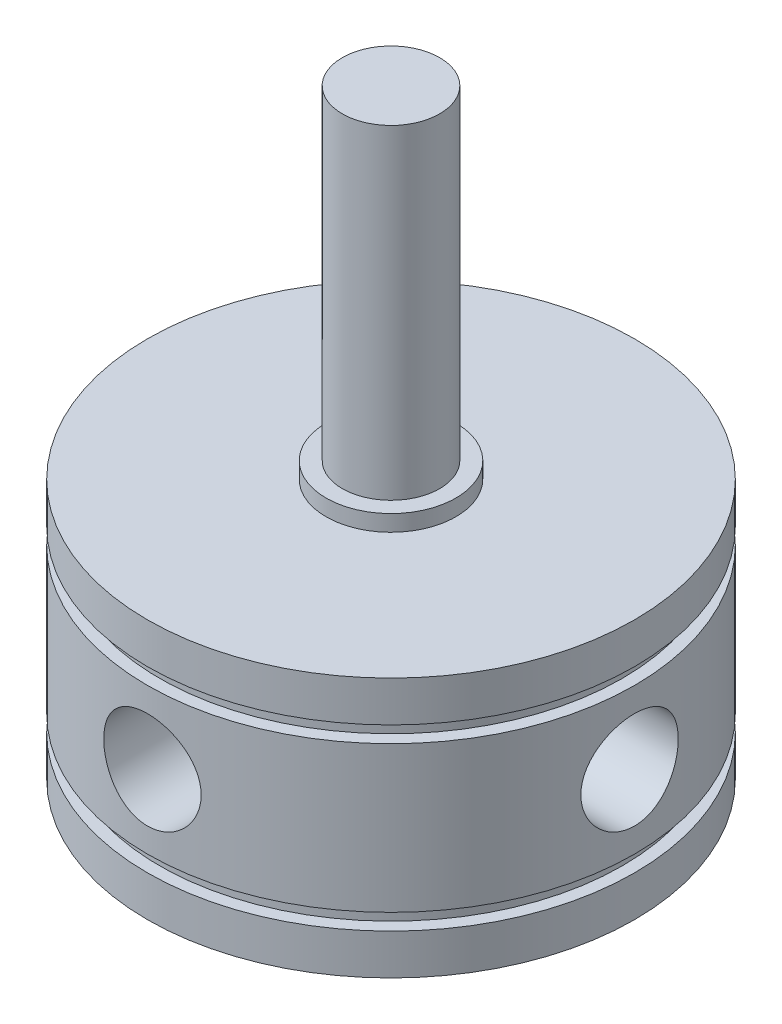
from build123d import *

# Parameters (mm, degrees)
ESBO_O3_R                = 3
FURO_PERPENDICULAR_DEPTH = 53.971690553
ESBO_O4_R                = 3


with BuildPart() as part:
    # Esbo_o2 → Revolu_o (revolve)
    with BuildSketch(Plane.XY, mode=Mode.PRIVATE) as revolu_o_sk:
        Polygon((0, 0), (0, 41), (3, 41), (3, 21), (4, 21), (4, 20), (15, 20), (15, 17.5), (14.25, 17.5), (14.25, 16.5), (15, 16.5), (15, 7.5), (14.25, 7.5), (14.25, 6.5), (15, 6.5), (15, 4), (4, 4), (4, 3), (3, 3), (3, 0), align=None)
    revolve(revolu_o_sk.sketch.rotate(Axis((0, 52.88343403, 0), (0, -1, 0)), 180), axis=Axis((0, 52.88343403, 0), (0, -1, 0)))

    # Esbo_o3 → Furo perpendicular (cut, through all)
    with BuildSketch(Plane(origin=(15, 0, 0), x_dir=(0, 0, -1), z_dir=(1, 0, 0))):
        with Locations(Location((0, 12, 0), (0, 0, 90))):
            Circle(ESBO_O3_R)
    extrude(amount=-FURO_PERPENDICULAR_DEPTH, mode=Mode.SUBTRACT)

    # Furo desviado a 25 graus: sweep along a path in Esbo_o5
    with BuildLine(Plane(origin=(0, 12, 0), x_dir=(1, 0, 0), z_dir=(0, 1, 0))) as furo_desviado_a_25_graus_path:
        Line((0, -15), (0, 0))
        Line((0, 0), (7.657725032, 16.422044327))
    # Esbo_o4 → Furo desviado a 25 graus (sweep, cut)
    with BuildSketch(Plane(origin=(0, 0, 15), x_dir=(0, 1, 0), z_dir=(0, 0, 1))):
        with Locations((12, 0)):
            Circle(ESBO_O4_R)
    sweep(path=furo_desviado_a_25_graus_path.line, transition=Transition.RIGHT, mode=Mode.SUBTRACT)


solid = part.part
